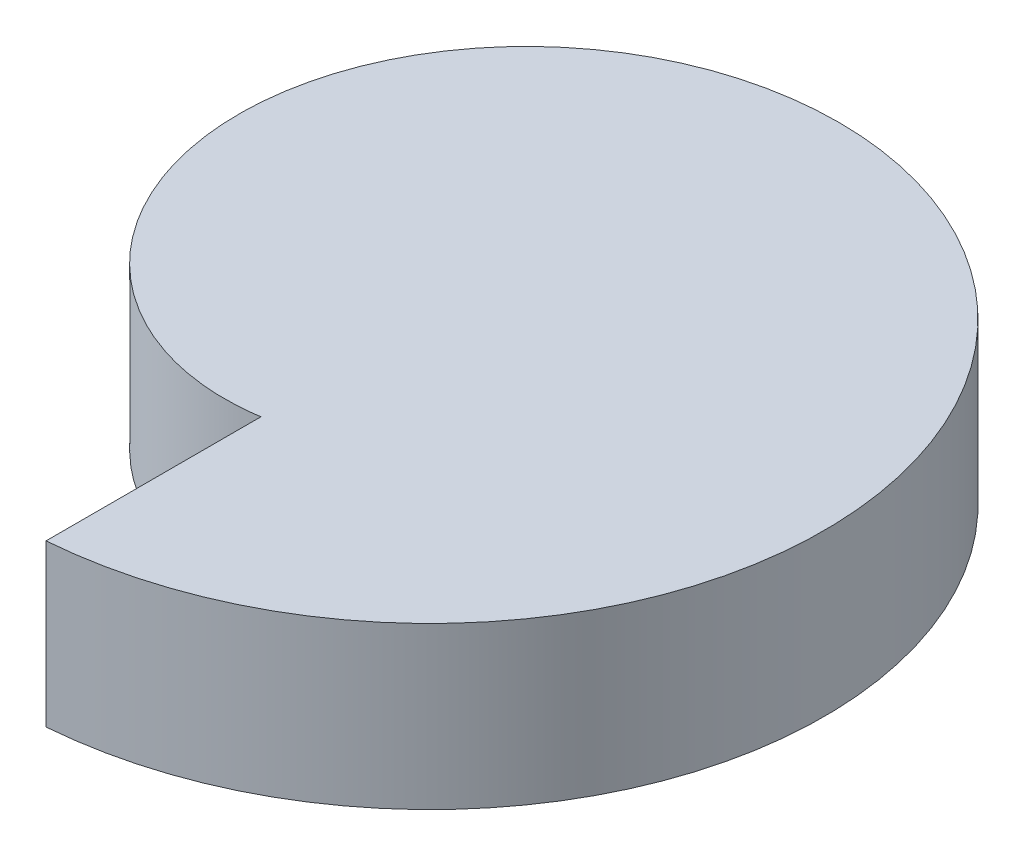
from build123d import *

# Parameters (mm, degrees)
BOSS_EXTRUDE1_DEPTH = 30


with BuildPart() as part:
    # Sketch3 → Boss-Extrude1 (new body)
    with BuildSketch(Plane(origin=(0, 0, 0), x_dir=(1, 0, 0), z_dir=(0, 1, 0))):
        with BuildLine():
            Line((0, -40.45), (0, -80.45))
            add(Edge.make_bspline(
                [(0, -40.45), (-2.647446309, -40.866666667), (-5.377162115, -41.022537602), (-10.893370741, -40.774954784), (-13.679711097, -40.371426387), (-19.192795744, -38.989825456), (-21.9193722, -38.011711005), (-27.193036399, -35.490202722), (-29.739947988, -33.94680277), (-34.536058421, -30.329203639), (-36.785080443, -28.255035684), (-40.874181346, -23.63522408), (-42.714090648, -21.089648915), (-45.88595652, -15.609692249), (-47.217758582, -12.675414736), (-49.29151301, -6.52147295), (-50.033333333, -3.301944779), (-50.866666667, 3.301944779), (-50.958076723, 6.68614287), (-50.455121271, 13.486196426), (-49.860687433, 16.90186768), (-47.97815506, 23.624307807), (-46.690026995, 26.930878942), (-43.441278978, 33.292934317), (-41.480670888, 36.348215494), (-36.937471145, 42.069926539), (-34.354933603, 44.736156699), (-28.646730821, 49.552497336), (-25.521160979, 51.702420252), (-18.831848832, 55.375217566), (-15.268240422, 56.897925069), (-7.830453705, 59.227052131), (-3.956443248, 60.033333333), (3.956443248, 60.866666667), (7.995123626, 60.893615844), (16.079022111, 60.135287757), (20.124024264, 59.349948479), (28.055819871, 56.966484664), (31.942385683, 55.368342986), (39.392832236, 51.392355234), (42.956483, 49.014539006), (49.603794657, 43.545738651), (52.687232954, 40.454831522), (58.230813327, 33.658237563), (60.690749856, 29.952673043), (64.864478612, 22.054005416), (66.578091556, 17.861066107), (69.162591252, 9.13943446), (70.033333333, 4.610941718), (70.866666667, -4.610941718), (70.829154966, -9.304104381), (69.815454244, -18.671847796), (68.839209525, -23.346180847), (65.954814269, -32.487331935), (64.046658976, -36.953892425), (59.34343149, -45.492730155), (56.548407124, -49.564750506), (50.154006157, -57.137662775), (46.554729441, -60.63830921), (38.669744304, -66.909129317), (34.384185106, -69.679079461), (25.276161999, -74.353739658), (20.453891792, -76.258258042), (10.448415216, -79.098130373), (5.265440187, -80.033333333), (0, -80.45)],
                knots=[0, 0, 0, 0, 0.03125, 0.03125, 0.0625, 0.0625, 0.09375, 0.09375, 0.125, 0.125, 0.15625, 0.15625, 0.1875, 0.1875, 0.21875, 0.21875, 0.25, 0.25, 0.28125, 0.28125, 0.3125, 0.3125, 0.34375, 0.34375, 0.375, 0.375, 0.40625, 0.40625, 0.4375, 0.4375, 0.46875, 0.46875, 0.5, 0.5, 0.53125, 0.53125, 0.5625, 0.5625, 0.59375, 0.59375, 0.625, 0.625, 0.65625, 0.65625, 0.6875, 0.6875, 0.71875, 0.71875, 0.75, 0.75, 0.78125, 0.78125, 0.8125, 0.8125, 0.84375, 0.84375, 0.875, 0.875, 0.90625, 0.90625, 0.9375, 0.9375, 0.96875, 0.96875, 1, 1, 1, 1], degree=3))
        make_face()
    extrude(amount=BOSS_EXTRUDE1_DEPTH)


solid = part.part
